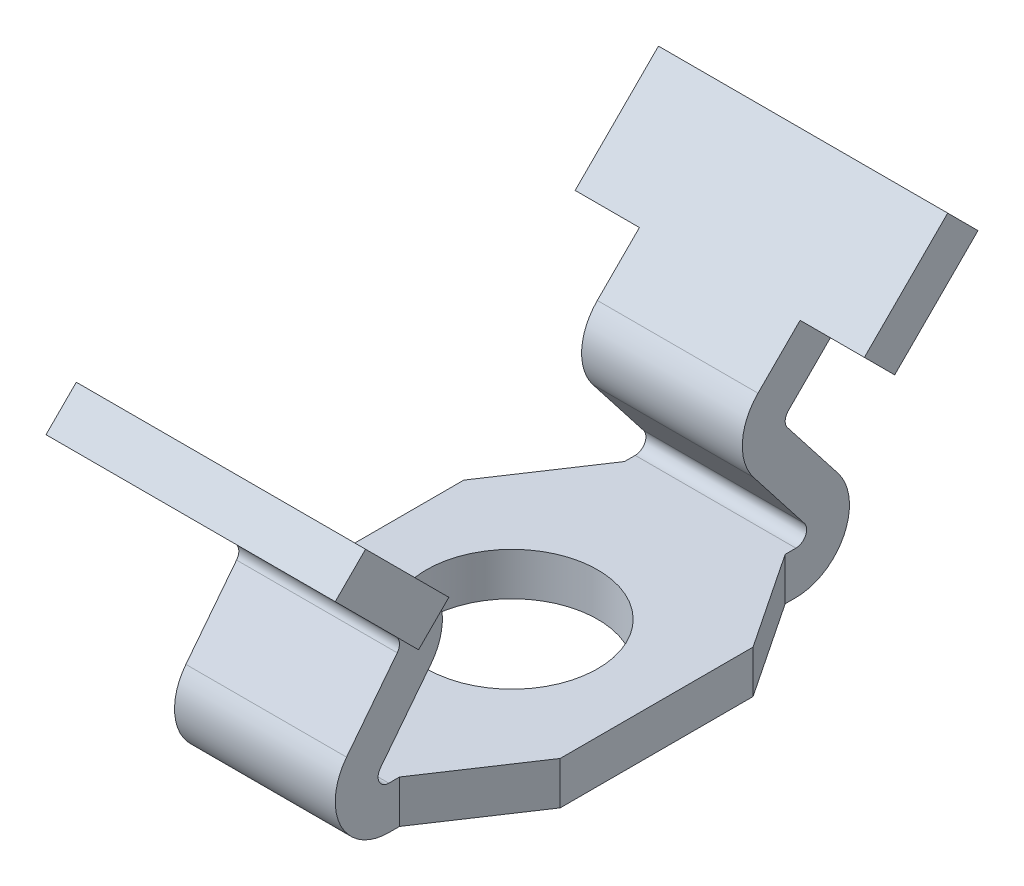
ISO-10303-21;
HEADER;
FILE_DESCRIPTION(('STEP AP214'),'2;1');
FILE_NAME('part.step','',(''),(''),'','','');
FILE_SCHEMA(('AUTOMOTIVE_DESIGN { 1 0 10303 214 1 1 1 1 }'));
ENDSEC;
DATA;
#1=APPLICATION_CONTEXT('core data for automotive mechanical design processes');
#2=APPLICATION_PROTOCOL_DEFINITION('international standard','automotive_design',2000,#1);
#3=PRODUCT_CONTEXT('',#1,'mechanical');
#4=PRODUCT('Part','Part','',(#3));
#5=PRODUCT_RELATED_PRODUCT_CATEGORY('part','',(#4));
#6=PRODUCT_DEFINITION_FORMATION('','',#4);
#7=PRODUCT_DEFINITION_CONTEXT('part definition',#1,'design');
#8=PRODUCT_DEFINITION('design','',#6,#7);
#9=PRODUCT_DEFINITION_SHAPE('','',#8);
#10=(LENGTH_UNIT() NAMED_UNIT(*) SI_UNIT(.MILLI.,.METRE.));
#11=(NAMED_UNIT(*) PLANE_ANGLE_UNIT() SI_UNIT($,.RADIAN.));
#12=(NAMED_UNIT(*) SI_UNIT($,.STERADIAN.) SOLID_ANGLE_UNIT());
#13=UNCERTAINTY_MEASURE_WITH_UNIT(LENGTH_MEASURE(1.E-05),#10,'distance_accuracy_value','');
#14=(GEOMETRIC_REPRESENTATION_CONTEXT(3) GLOBAL_UNCERTAINTY_ASSIGNED_CONTEXT((#13)) GLOBAL_UNIT_ASSIGNED_CONTEXT((#10,
#11,#12)) REPRESENTATION_CONTEXT('',''));
#15=CARTESIAN_POINT('',(0.,0.,0.));
#16=DIRECTION('',(0.,0.,1.));
#17=DIRECTION('',(1.,0.,0.));
#18=AXIS2_PLACEMENT_3D('',#15,#16,#17);
#19=CARTESIAN_POINT('',(6.75,-2.74452334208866,0.));
#20=DIRECTION('',(1.,0.,0.));
#21=DIRECTION('',(0.,0.,-1.));
#22=AXIS2_PLACEMENT_3D('',#19,#20,#21);
#23=PLANE('',#22);
#24=DIRECTION('',(0.,-0.707106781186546,0.707106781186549));
#25=VECTOR('',#24,1.);
#26=CARTESIAN_POINT('',(6.75,5.18884242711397,15.0000000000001));
#27=LINE('',#26,#25);
#28=CARTESIAN_POINT('',(6.75,5.18884242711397,15.0000000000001));
#29=VERTEX_POINT('',#28);
#30=CARTESIAN_POINT('',(6.75000000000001,6.60305598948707,13.585786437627));
#31=VERTEX_POINT('',#30);
#32=EDGE_CURVE('E453',#29,#31,#27,.F.);
#33=ORIENTED_EDGE('',*,*,#32,.F.);
#34=DIRECTION('',(0.,-0.707106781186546,-0.707106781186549));
#35=VECTOR('',#34,1.);
#36=CARTESIAN_POINT('',(6.75,1.29975513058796,11.110912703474));
#37=LINE('',#36,#35);
#38=CARTESIAN_POINT('',(6.75,1.29975513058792,11.110912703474));
#39=VERTEX_POINT('',#38);
#40=EDGE_CURVE('E418',#39,#29,#37,.F.);
#41=ORIENTED_EDGE('',*,*,#40,.F.);
#42=DIRECTION('',(0.,-0.707106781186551,0.707106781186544));
#43=VECTOR('',#42,1.);
#44=CARTESIAN_POINT('',(6.75,0.,12.4106678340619));
#45=LINE('',#44,#43);
#46=CARTESIAN_POINT('',(6.75000000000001,2.71396869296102,9.69669914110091));
#47=VERTEX_POINT('',#46);
#48=EDGE_CURVE('E441',#39,#47,#45,.F.);
#49=ORIENTED_EDGE('',*,*,#48,.T.);
#50=DIRECTION('',(0.,0.707106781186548,0.707106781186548));
#51=VECTOR('',#50,1.);
#52=CARTESIAN_POINT('',(6.75000000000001,2.71396869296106,9.69669914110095));
#53=LINE('',#52,#51);
#54=EDGE_CURVE('E412',#31,#47,#53,.F.);
#55=ORIENTED_EDGE('',*,*,#54,.F.);
#56=EDGE_LOOP('',(#33,#41,#49,#55));
#57=FACE_BOUND('',#56,.T.);
#58=ADVANCED_FACE('F15',(#57),#23,.T.);
#59=CARTESIAN_POINT('',(-6.75,5.18884242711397,15.0000000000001));
#60=DIRECTION('',(0.,0.707106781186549,0.707106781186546));
#61=DIRECTION('',(0.,-0.707106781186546,0.707106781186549));
#62=AXIS2_PLACEMENT_3D('',#59,#60,#61);
#63=PLANE('',#62);
#64=DIRECTION('',(0.,-0.707106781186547,0.707106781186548));
#65=VECTOR('',#64,1.);
#66=CARTESIAN_POINT('',(-6.75,6.60305598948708,13.585786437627));
#67=LINE('',#66,#65);
#68=CARTESIAN_POINT('',(-6.75,6.60305598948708,13.585786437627));
#69=VERTEX_POINT('',#68);
#70=CARTESIAN_POINT('',(-6.75,5.18884242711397,15.0000000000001));
#71=VERTEX_POINT('',#70);
#72=EDGE_CURVE('E436',#69,#71,#67,.T.);
#73=ORIENTED_EDGE('',*,*,#72,.T.);
#74=DIRECTION('',(1.,0.,0.));
#75=VECTOR('',#74,1.);
#76=CARTESIAN_POINT('',(-6.75,5.18884242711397,15.0000000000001));
#77=LINE('',#76,#75);
#78=EDGE_CURVE('E451',#29,#71,#77,.F.);
#79=ORIENTED_EDGE('',*,*,#78,.F.);
#80=ORIENTED_EDGE('',*,*,#32,.T.);
#81=DIRECTION('',(1.,0.,0.));
#82=VECTOR('',#81,1.);
#83=CARTESIAN_POINT('',(-6.75,6.60305598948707,13.585786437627));
#84=LINE('',#83,#82);
#85=EDGE_CURVE('E462',#69,#31,#84,.T.);
#86=ORIENTED_EDGE('',*,*,#85,.F.);
#87=EDGE_LOOP('',(#73,#79,#80,#86));
#88=FACE_BOUND('',#87,.T.);
#89=ADVANCED_FACE('F883',(#88),#63,.T.);
#90=CARTESIAN_POINT('',(-6.75,-2.74452334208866,0.));
#91=DIRECTION('',(1.,0.,0.));
#92=DIRECTION('',(0.,0.,-1.));
#93=AXIS2_PLACEMENT_3D('',#90,#91,#92);
#94=PLANE('',#93);
#95=DIRECTION('',(0.,-0.707106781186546,-0.707106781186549));
#96=VECTOR('',#95,1.);
#97=CARTESIAN_POINT('',(-6.75,1.29975513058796,11.110912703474));
#98=LINE('',#97,#96);
#99=CARTESIAN_POINT('',(-6.75,1.29975513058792,11.110912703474));
#100=VERTEX_POINT('',#99);
#101=EDGE_CURVE('E389',#71,#100,#98,.T.);
#102=ORIENTED_EDGE('',*,*,#101,.F.);
#103=ORIENTED_EDGE('',*,*,#72,.F.);
#104=DIRECTION('',(0.,0.707106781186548,0.707106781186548));
#105=VECTOR('',#104,1.);
#106=CARTESIAN_POINT('',(-6.75,2.71396869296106,9.69669914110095));
#107=LINE('',#106,#105);
#108=CARTESIAN_POINT('',(-6.75,2.71396869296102,9.69669914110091));
#109=VERTEX_POINT('',#108);
#110=EDGE_CURVE('E404',#109,#69,#107,.T.);
#111=ORIENTED_EDGE('',*,*,#110,.F.);
#112=DIRECTION('',(0.,-0.707106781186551,0.707106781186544));
#113=VECTOR('',#112,1.);
#114=CARTESIAN_POINT('',(-6.75,12.410667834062,0.));
#115=LINE('',#114,#113);
#116=EDGE_CURVE('E384',#109,#100,#115,.T.);
#117=ORIENTED_EDGE('',*,*,#116,.T.);
#118=EDGE_LOOP('',(#102,#103,#111,#117));
#119=FACE_BOUND('',#118,.T.);
#120=ADVANCED_FACE('F876',(#119),#94,.F.);
#121=CARTESIAN_POINT('',(6.75,-2.74452334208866,0.));
#122=DIRECTION('',(1.,0.,0.));
#123=DIRECTION('',(0.,0.,-1.));
#124=AXIS2_PLACEMENT_3D('',#121,#122,#123);
#125=PLANE('',#124);
#126=DIRECTION('',(0.,0.707106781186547,0.707106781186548));
#127=VECTOR('',#126,1.);
#128=CARTESIAN_POINT('',(6.75,6.60305598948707,-13.5857864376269));
#129=LINE('',#128,#127);
#130=CARTESIAN_POINT('',(6.75,6.60305598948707,-13.5857864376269));
#131=VERTEX_POINT('',#130);
#132=CARTESIAN_POINT('',(6.75,5.18884242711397,-15.));
#133=VERTEX_POINT('',#132);
#134=EDGE_CURVE('E432',#131,#133,#129,.F.);
#135=ORIENTED_EDGE('',*,*,#134,.F.);
#136=DIRECTION('',(0.,-0.707106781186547,0.707106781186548));
#137=VECTOR('',#136,1.);
#138=CARTESIAN_POINT('',(6.75,2.71396869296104,-9.69669914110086));
#139=LINE('',#138,#137);
#140=CARTESIAN_POINT('',(6.75,2.71396869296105,-9.69669914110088));
#141=VERTEX_POINT('',#140);
#142=EDGE_CURVE('E424',#141,#131,#139,.F.);
#143=ORIENTED_EDGE('',*,*,#142,.F.);
#144=DIRECTION('',(0.,0.707106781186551,0.707106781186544));
#145=VECTOR('',#144,1.);
#146=CARTESIAN_POINT('',(6.75,12.410667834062,0.));
#147=LINE('',#146,#145);
#148=CARTESIAN_POINT('',(6.75,1.29975513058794,-11.110912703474));
#149=VERTEX_POINT('',#148);
#150=EDGE_CURVE('E439',#141,#149,#147,.F.);
#151=ORIENTED_EDGE('',*,*,#150,.T.);
#152=DIRECTION('',(0.,0.707106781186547,-0.707106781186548));
#153=VECTOR('',#152,1.);
#154=CARTESIAN_POINT('',(6.75,1.29975513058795,-11.110912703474));
#155=LINE('',#154,#153);
#156=EDGE_CURVE('E419',#133,#149,#155,.F.);
#157=ORIENTED_EDGE('',*,*,#156,.F.);
#158=EDGE_LOOP('',(#135,#143,#151,#157));
#159=FACE_BOUND('',#158,.T.);
#160=ADVANCED_FACE('F627',(#159),#125,.T.);
#161=CARTESIAN_POINT('',(-6.75,6.60305598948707,-13.5857864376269));
#162=DIRECTION('',(0.,0.707106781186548,-0.707106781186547));
#163=DIRECTION('',(0.,0.707106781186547,0.707106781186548));
#164=AXIS2_PLACEMENT_3D('',#161,#162,#163);
#165=PLANE('',#164);
#166=DIRECTION('',(0.,0.707106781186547,0.707106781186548));
#167=VECTOR('',#166,1.);
#168=CARTESIAN_POINT('',(-6.75,5.18884242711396,-15.));
#169=LINE('',#168,#167);
#170=CARTESIAN_POINT('',(-6.75,5.18884242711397,-15.));
#171=VERTEX_POINT('',#170);
#172=CARTESIAN_POINT('',(-6.75,6.60305598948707,-13.5857864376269));
#173=VERTEX_POINT('',#172);
#174=EDGE_CURVE('E258',#171,#173,#169,.T.);
#175=ORIENTED_EDGE('',*,*,#174,.T.);
#176=DIRECTION('',(1.,0.,0.));
#177=VECTOR('',#176,1.);
#178=CARTESIAN_POINT('',(-6.75,6.60305598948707,-13.5857864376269));
#179=LINE('',#178,#177);
#180=EDGE_CURVE('E430',#131,#173,#179,.F.);
#181=ORIENTED_EDGE('',*,*,#180,.F.);
#182=ORIENTED_EDGE('',*,*,#134,.T.);
#183=DIRECTION('',(1.,0.,0.));
#184=VECTOR('',#183,1.);
#185=CARTESIAN_POINT('',(-6.75,5.18884242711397,-15.));
#186=LINE('',#185,#184);
#187=EDGE_CURVE('E444',#171,#133,#186,.T.);
#188=ORIENTED_EDGE('',*,*,#187,.F.);
#189=EDGE_LOOP('',(#175,#181,#182,#188));
#190=FACE_BOUND('',#189,.T.);
#191=ADVANCED_FACE('F631',(#190),#165,.T.);
#192=CARTESIAN_POINT('',(-6.75,-2.74452334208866,0.));
#193=DIRECTION('',(1.,0.,0.));
#194=DIRECTION('',(0.,0.,-1.));
#195=AXIS2_PLACEMENT_3D('',#192,#193,#194);
#196=PLANE('',#195);
#197=DIRECTION('',(0.,-0.707106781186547,0.707106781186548));
#198=VECTOR('',#197,1.);
#199=CARTESIAN_POINT('',(-6.75,2.71396869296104,-9.69669914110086));
#200=LINE('',#199,#198);
#201=CARTESIAN_POINT('',(-6.75,2.71396869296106,-9.69669914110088));
#202=VERTEX_POINT('',#201);
#203=EDGE_CURVE('E357',#173,#202,#200,.T.);
#204=ORIENTED_EDGE('',*,*,#203,.F.);
#205=ORIENTED_EDGE('',*,*,#174,.F.);
#206=DIRECTION('',(0.,0.707106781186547,-0.707106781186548));
#207=VECTOR('',#206,1.);
#208=CARTESIAN_POINT('',(-6.75,1.29975513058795,-11.110912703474));
#209=LINE('',#208,#207);
#210=CARTESIAN_POINT('',(-6.75,1.29975513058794,-11.110912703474));
#211=VERTEX_POINT('',#210);
#212=EDGE_CURVE('E388',#211,#171,#209,.T.);
#213=ORIENTED_EDGE('',*,*,#212,.F.);
#214=DIRECTION('',(0.,0.707106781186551,0.707106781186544));
#215=VECTOR('',#214,1.);
#216=CARTESIAN_POINT('',(-6.75,0.,-12.4106678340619));
#217=LINE('',#216,#215);
#218=EDGE_CURVE('E363',#211,#202,#217,.T.);
#219=ORIENTED_EDGE('',*,*,#218,.T.);
#220=EDGE_LOOP('',(#204,#205,#213,#219));
#221=FACE_BOUND('',#220,.T.);
#222=ADVANCED_FACE('F634',(#221),#196,.F.);
#223=CARTESIAN_POINT('',(-6.75,-1.01826435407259,-9.49999999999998));
#224=DIRECTION('',(1.,0.,0.));
#225=DIRECTION('',(0.,0.,-1.));
#226=AXIS2_PLACEMENT_3D('',#223,#224,#225);
#227=CYLINDRICAL_SURFACE('',#226,0.499999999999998);
#228=DIRECTION('',(1.,0.,0.));
#229=VECTOR('',#228,1.);
#230=CARTESIAN_POINT('',(-6.75,-0.664710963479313,-9.14644660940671));
#231=LINE('',#230,#229);
#232=CARTESIAN_POINT('',(3.75,-0.664710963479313,-9.14644660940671));
#233=VERTEX_POINT('',#232);
#234=CARTESIAN_POINT('',(-3.75,-0.664710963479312,-9.14644660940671));
#235=VERTEX_POINT('',#234);
#236=EDGE_CURVE('E260',#233,#235,#231,.F.);
#237=ORIENTED_EDGE('',*,*,#236,.F.);
#238=CARTESIAN_POINT('',(3.75,-1.01826435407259,-9.49999999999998));
#239=DIRECTION('',(1.,0.,0.));
#240=DIRECTION('',(0.,0.,-1.));
#241=AXIS2_PLACEMENT_3D('',#238,#239,#240);
#242=CIRCLE('',#241,0.499999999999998);
#243=CARTESIAN_POINT('',(3.75,-1.32572459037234,-9.1057054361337));
#244=VERTEX_POINT('',#243);
#245=EDGE_CURVE('E18',#244,#233,#242,.F.);
#246=ORIENTED_EDGE('',*,*,#245,.F.);
#247=DIRECTION('',(1.,0.,0.));
#248=VECTOR('',#247,1.);
#249=CARTESIAN_POINT('',(-6.75,-1.32572459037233,-9.1057054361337));
#250=LINE('',#249,#248);
#251=CARTESIAN_POINT('',(-3.75,-1.32572459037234,-9.1057054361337));
#252=VERTEX_POINT('',#251);
#253=EDGE_CURVE('E291',#252,#244,#250,.T.);
#254=ORIENTED_EDGE('',*,*,#253,.F.);
#255=CARTESIAN_POINT('',(-3.75,-1.01826435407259,-9.49999999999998));
#256=DIRECTION('',(1.,0.,0.));
#257=DIRECTION('',(0.,0.,-1.));
#258=AXIS2_PLACEMENT_3D('',#255,#256,#257);
#259=CIRCLE('',#258,0.499999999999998);
#260=EDGE_CURVE('E257',#235,#252,#259,.T.);
#261=ORIENTED_EDGE('',*,*,#260,.F.);
#262=EDGE_LOOP('',(#237,#246,#254,#261));
#263=FACE_BOUND('',#262,.T.);
#264=ADVANCED_FACE('F261',(#263),#227,.F.);
#265=CARTESIAN_POINT('',(3.75,12.410667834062,0.));
#266=DIRECTION('',(0.,0.707106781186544,-0.707106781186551));
#267=DIRECTION('',(0.,0.707106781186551,0.707106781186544));
#268=AXIS2_PLACEMENT_3D('',#265,#266,#267);
#269=PLANE('',#268);
#270=DIRECTION('',(0.,-0.70710678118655,-0.707106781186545));
#271=VECTOR('',#270,1.);
#272=CARTESIAN_POINT('',(3.75,2.71396869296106,-9.69669914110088));
#273=LINE('',#272,#271);
#274=CARTESIAN_POINT('',(3.75,2.71396869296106,-9.69669914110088));
#275=VERTEX_POINT('',#274);
#276=CARTESIAN_POINT('',(3.75,1.29975513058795,-11.110912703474));
#277=VERTEX_POINT('',#276);
#278=EDGE_CURVE('E272',#275,#277,#273,.T.);
#279=ORIENTED_EDGE('',*,*,#278,.T.);
#280=DIRECTION('',(1.,0.,0.));
#281=VECTOR('',#280,1.);
#282=CARTESIAN_POINT('',(-6.75,1.29975513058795,-11.110912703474));
#283=LINE('',#282,#281);
#284=EDGE_CURVE('E265',#149,#277,#283,.F.);
#285=ORIENTED_EDGE('',*,*,#284,.F.);
#286=ORIENTED_EDGE('',*,*,#150,.F.);
#287=DIRECTION('',(1.,0.,0.));
#288=VECTOR('',#287,1.);
#289=CARTESIAN_POINT('',(-6.75,2.71396869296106,-9.69669914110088));
#290=LINE('',#289,#288);
#291=EDGE_CURVE('E421',#275,#141,#290,.T.);
#292=ORIENTED_EDGE('',*,*,#291,.F.);
#293=EDGE_LOOP('',(#279,#285,#286,#292));
#294=FACE_BOUND('',#293,.T.);
#295=ADVANCED_FACE('F624',(#294),#269,.F.);
#296=CARTESIAN_POINT('',(3.75,0.,12.4106678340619));
#297=DIRECTION('',(0.,0.707106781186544,0.707106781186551));
#298=DIRECTION('',(0.,-0.707106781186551,0.707106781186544));
#299=AXIS2_PLACEMENT_3D('',#296,#297,#298);
#300=PLANE('',#299);
#301=ORIENTED_EDGE('',*,*,#48,.F.);
#302=DIRECTION('',(1.,0.,0.));
#303=VECTOR('',#302,1.);
#304=CARTESIAN_POINT('',(-6.75,1.29975513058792,11.110912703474));
#305=LINE('',#304,#303);
#306=CARTESIAN_POINT('',(3.75,1.29975513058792,11.110912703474));
#307=VERTEX_POINT('',#306);
#308=EDGE_CURVE('E383',#307,#39,#305,.T.);
#309=ORIENTED_EDGE('',*,*,#308,.F.);
#310=DIRECTION('',(0.,0.707106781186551,-0.707106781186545));
#311=VECTOR('',#310,1.);
#312=CARTESIAN_POINT('',(3.75,1.29975513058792,11.110912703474));
#313=LINE('',#312,#311);
#314=CARTESIAN_POINT('',(3.75,2.71396869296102,9.69669914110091));
#315=VERTEX_POINT('',#314);
#316=EDGE_CURVE('E413',#307,#315,#313,.T.);
#317=ORIENTED_EDGE('',*,*,#316,.T.);
#318=DIRECTION('',(1.,0.,0.));
#319=VECTOR('',#318,1.);
#320=CARTESIAN_POINT('',(-6.75,2.71396869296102,9.69669914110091));
#321=LINE('',#320,#319);
#322=EDGE_CURVE('E400',#47,#315,#321,.F.);
#323=ORIENTED_EDGE('',*,*,#322,.F.);
#324=EDGE_LOOP('',(#301,#309,#317,#323));
#325=FACE_BOUND('',#324,.T.);
#326=ADVANCED_FACE('F838',(#325),#300,.F.);
#327=CARTESIAN_POINT('',(-6.75,-1.01826435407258,9.50000000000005));
#328=DIRECTION('',(1.,0.,0.));
#329=DIRECTION('',(0.,0.,-1.));
#330=AXIS2_PLACEMENT_3D('',#327,#328,#329);
#331=CYLINDRICAL_SURFACE('',#330,0.5);
#332=DIRECTION('',(1.,0.,0.));
#333=VECTOR('',#332,1.);
#334=CARTESIAN_POINT('',(-6.75,-1.32572459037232,9.10570543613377));
#335=LINE('',#334,#333);
#336=CARTESIAN_POINT('',(3.75,-1.32572459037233,9.10570543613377));
#337=VERTEX_POINT('',#336);
#338=CARTESIAN_POINT('',(-3.75,-1.32572459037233,9.10570543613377));
#339=VERTEX_POINT('',#338);
#340=EDGE_CURVE('E376',#337,#339,#335,.F.);
#341=ORIENTED_EDGE('',*,*,#340,.F.);
#342=CARTESIAN_POINT('',(3.75,-1.01826435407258,9.50000000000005));
#343=DIRECTION('',(1.,0.,0.));
#344=DIRECTION('',(0.,0.,-1.));
#345=AXIS2_PLACEMENT_3D('',#342,#343,#344);
#346=CIRCLE('',#345,0.5);
#347=CARTESIAN_POINT('',(3.75,-0.664710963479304,9.14644660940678));
#348=VERTEX_POINT('',#347);
#349=EDGE_CURVE('E271',#337,#348,#346,.T.);
#350=ORIENTED_EDGE('',*,*,#349,.T.);
#351=DIRECTION('',(1.,0.,0.));
#352=VECTOR('',#351,1.);
#353=CARTESIAN_POINT('',(-6.75,-0.664710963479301,9.14644660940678));
#354=LINE('',#353,#352);
#355=CARTESIAN_POINT('',(-3.75,-0.664710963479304,9.14644660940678));
#356=VERTEX_POINT('',#355);
#357=EDGE_CURVE('E380',#356,#348,#354,.T.);
#358=ORIENTED_EDGE('',*,*,#357,.F.);
#359=CARTESIAN_POINT('',(-3.75,-1.01826435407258,9.50000000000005));
#360=DIRECTION('',(1.,0.,0.));
#361=DIRECTION('',(0.,0.,-1.));
#362=AXIS2_PLACEMENT_3D('',#359,#360,#361);
#363=CIRCLE('',#362,0.5);
#364=EDGE_CURVE('E405',#339,#356,#363,.T.);
#365=ORIENTED_EDGE('',*,*,#364,.F.);
#366=EDGE_LOOP('',(#341,#350,#358,#365));
#367=FACE_BOUND('',#366,.T.);
#368=ADVANCED_FACE('F560',(#367),#331,.F.);
#369=CARTESIAN_POINT('',(-6.75,-2.55556553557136,7.52852718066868));
#370=DIRECTION('',(0.,-0.614920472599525,-0.788589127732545));
#371=DIRECTION('',(0.,0.788589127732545,-0.614920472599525));
#372=AXIS2_PLACEMENT_3D('',#369,#370,#371);
#373=PLANE('',#372);
#374=DIRECTION('',(0.,-0.788589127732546,0.614920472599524));
#375=VECTOR('',#374,1.);
#376=CARTESIAN_POINT('',(3.75,-2.55556553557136,7.52852718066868));
#377=LINE('',#376,#375);
#378=CARTESIAN_POINT('',(3.75,-2.55556553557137,7.52852718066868));
#379=VERTEX_POINT('',#378);
#380=CARTESIAN_POINT('',(3.75,-5.58948377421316,9.89429456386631));
#381=VERTEX_POINT('',#380);
#382=EDGE_CURVE('E494',#379,#381,#377,.T.);
#383=ORIENTED_EDGE('',*,*,#382,.T.);
#384=DIRECTION('',(1.,0.,0.));
#385=VECTOR('',#384,1.);
#386=CARTESIAN_POINT('',(-6.75,-5.58948377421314,9.8942945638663));
#387=LINE('',#386,#385);
#388=CARTESIAN_POINT('',(-3.75,-5.58948377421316,9.89429456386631));
#389=VERTEX_POINT('',#388);
#390=EDGE_CURVE('E350',#381,#389,#387,.F.);
#391=ORIENTED_EDGE('',*,*,#390,.T.);
#392=DIRECTION('',(0.,0.788589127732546,-0.614920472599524));
#393=VECTOR('',#392,1.);
#394=CARTESIAN_POINT('',(-3.75,-5.58948377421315,9.8942945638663));
#395=LINE('',#394,#393);
#396=CARTESIAN_POINT('',(-3.75,-2.55556553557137,7.52852718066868));
#397=VERTEX_POINT('',#396);
#398=EDGE_CURVE('E379',#389,#397,#395,.T.);
#399=ORIENTED_EDGE('',*,*,#398,.T.);
#400=DIRECTION('',(1.,0.,0.));
#401=VECTOR('',#400,1.);
#402=CARTESIAN_POINT('',(-6.75,-2.55556553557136,7.52852718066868));
#403=LINE('',#402,#401);
#404=EDGE_CURVE('E401',#379,#397,#403,.F.);
#405=ORIENTED_EDGE('',*,*,#404,.F.);
#406=EDGE_LOOP('',(#383,#391,#399,#405));
#407=FACE_BOUND('',#406,.T.);
#408=ADVANCED_FACE('F581',(#407),#373,.T.);
#409=CARTESIAN_POINT('',(-6.75,-1.01826435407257,9.50000000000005));
#410=DIRECTION('',(1.,0.,0.));
#411=DIRECTION('',(0.,0.,-1.));
#412=AXIS2_PLACEMENT_3D('',#409,#410,#411);
#413=CYLINDRICAL_SURFACE('',#412,2.5);
#414=CARTESIAN_POINT('',(3.75,-1.01826435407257,9.50000000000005));
#415=DIRECTION('',(1.,0.,0.));
#416=DIRECTION('',(0.,0.,-1.));
#417=AXIS2_PLACEMENT_3D('',#414,#415,#416);
#418=CIRCLE('',#417,2.5);
#419=CARTESIAN_POINT('',(3.75,0.749502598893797,7.73223304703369));
#420=VERTEX_POINT('',#419);
#421=EDGE_CURVE('E495',#420,#379,#418,.F.);
#422=ORIENTED_EDGE('',*,*,#421,.T.);
#423=ORIENTED_EDGE('',*,*,#404,.T.);
#424=CARTESIAN_POINT('',(-3.75,-1.01826435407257,9.50000000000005));
#425=DIRECTION('',(1.,0.,0.));
#426=DIRECTION('',(0.,0.,-1.));
#427=AXIS2_PLACEMENT_3D('',#424,#425,#426);
#428=CIRCLE('',#427,2.5);
#429=CARTESIAN_POINT('',(-3.75,0.749502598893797,7.73223304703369));
#430=VERTEX_POINT('',#429);
#431=EDGE_CURVE('E489',#397,#430,#428,.T.);
#432=ORIENTED_EDGE('',*,*,#431,.T.);
#433=DIRECTION('',(1.,0.,0.));
#434=VECTOR('',#433,1.);
#435=CARTESIAN_POINT('',(-6.75,0.749502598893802,7.73223304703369));
#436=LINE('',#435,#434);
#437=EDGE_CURVE('E397',#420,#430,#436,.F.);
#438=ORIENTED_EDGE('',*,*,#437,.F.);
#439=EDGE_LOOP('',(#422,#423,#432,#438));
#440=FACE_BOUND('',#439,.T.);
#441=ADVANCED_FACE('F577',(#440),#413,.T.);
#442=CARTESIAN_POINT('',(-6.75,2.71396869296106,9.69669914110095));
#443=DIRECTION('',(0.,0.707106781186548,-0.707106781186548));
#444=DIRECTION('',(0.,0.707106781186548,0.707106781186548));
#445=AXIS2_PLACEMENT_3D('',#442,#443,#444);
#446=PLANE('',#445);
#447=DIRECTION('',(0.,-0.707106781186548,-0.707106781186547));
#448=VECTOR('',#447,1.);
#449=CARTESIAN_POINT('',(3.75,2.71396869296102,9.69669914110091));
#450=LINE('',#449,#448);
#451=EDGE_CURVE('E415',#315,#420,#450,.T.);
#452=ORIENTED_EDGE('',*,*,#451,.T.);
#453=ORIENTED_EDGE('',*,*,#437,.T.);
#454=DIRECTION('',(0.,0.707106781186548,0.707106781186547));
#455=VECTOR('',#454,1.);
#456=CARTESIAN_POINT('',(-3.75,0.749502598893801,7.73223304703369));
#457=LINE('',#456,#455);
#458=CARTESIAN_POINT('',(-3.75,2.71396869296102,9.69669914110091));
#459=VERTEX_POINT('',#458);
#460=EDGE_CURVE('E393',#430,#459,#457,.T.);
#461=ORIENTED_EDGE('',*,*,#460,.T.);
#462=DIRECTION('',(1.,0.,0.));
#463=VECTOR('',#462,1.);
#464=CARTESIAN_POINT('',(-3.75,2.71396869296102,9.69669914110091));
#465=LINE('',#464,#463);
#466=EDGE_CURVE('E394',#459,#109,#465,.F.);
#467=ORIENTED_EDGE('',*,*,#466,.T.);
#468=ORIENTED_EDGE('',*,*,#110,.T.);
#469=ORIENTED_EDGE('',*,*,#85,.T.);
#470=ORIENTED_EDGE('',*,*,#54,.T.);
#471=ORIENTED_EDGE('',*,*,#322,.T.);
#472=EDGE_LOOP('',(#452,#453,#461,#467,#468,#469,#470,#471));
#473=FACE_BOUND('',#472,.T.);
#474=ADVANCED_FACE('F573',(#473),#446,.T.);
#475=CARTESIAN_POINT('',(-3.75,12.410667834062,0.));
#476=DIRECTION('',(0.,0.707106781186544,0.707106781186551));
#477=DIRECTION('',(0.,-0.707106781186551,0.707106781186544));
#478=AXIS2_PLACEMENT_3D('',#475,#476,#477);
#479=PLANE('',#478);
#480=ORIENTED_EDGE('',*,*,#116,.F.);
#481=ORIENTED_EDGE('',*,*,#466,.F.);
#482=DIRECTION('',(0.,-0.707106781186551,0.707106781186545));
#483=VECTOR('',#482,1.);
#484=CARTESIAN_POINT('',(-3.75,2.71396869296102,9.69669914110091));
#485=LINE('',#484,#483);
#486=CARTESIAN_POINT('',(-3.75,1.29975513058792,11.110912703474));
#487=VERTEX_POINT('',#486);
#488=EDGE_CURVE('E390',#459,#487,#485,.T.);
#489=ORIENTED_EDGE('',*,*,#488,.T.);
#490=DIRECTION('',(1.,0.,0.));
#491=VECTOR('',#490,1.);
#492=CARTESIAN_POINT('',(-6.75,1.29975513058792,11.110912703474));
#493=LINE('',#492,#491);
#494=EDGE_CURVE('E385',#100,#487,#493,.T.);
#495=ORIENTED_EDGE('',*,*,#494,.F.);
#496=EDGE_LOOP('',(#480,#481,#489,#495));
#497=FACE_BOUND('',#496,.T.);
#498=ADVANCED_FACE('F570',(#497),#479,.F.);
#499=CARTESIAN_POINT('',(-6.75,1.29975513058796,11.110912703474));
#500=DIRECTION('',(0.,-0.707106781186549,0.707106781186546));
#501=DIRECTION('',(0.,-0.707106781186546,-0.707106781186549));
#502=AXIS2_PLACEMENT_3D('',#499,#500,#501);
#503=PLANE('',#502);
#504=ORIENTED_EDGE('',*,*,#101,.T.);
#505=ORIENTED_EDGE('',*,*,#494,.T.);
#506=DIRECTION('',(0.,-0.707106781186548,-0.707106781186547));
#507=VECTOR('',#506,1.);
#508=CARTESIAN_POINT('',(-3.75,1.29975513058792,11.110912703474));
#509=LINE('',#508,#507);
#510=EDGE_CURVE('E392',#487,#356,#509,.T.);
#511=ORIENTED_EDGE('',*,*,#510,.T.);
#512=ORIENTED_EDGE('',*,*,#357,.T.);
#513=DIRECTION('',(0.,0.707106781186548,0.707106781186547));
#514=VECTOR('',#513,1.);
#515=CARTESIAN_POINT('',(3.75,-0.664710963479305,9.14644660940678));
#516=LINE('',#515,#514);
#517=EDGE_CURVE('E274',#348,#307,#516,.T.);
#518=ORIENTED_EDGE('',*,*,#517,.T.);
#519=ORIENTED_EDGE('',*,*,#308,.T.);
#520=ORIENTED_EDGE('',*,*,#40,.T.);
#521=ORIENTED_EDGE('',*,*,#78,.T.);
#522=EDGE_LOOP('',(#504,#505,#511,#512,#518,#519,#520,#521));
#523=FACE_BOUND('',#522,.T.);
#524=ADVANCED_FACE('F565',(#523),#503,.T.);
#525=CARTESIAN_POINT('',(-6.75,-5.58948377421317,-9.89429456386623));
#526=DIRECTION('',(0.,-0.614920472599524,0.788589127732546));
#527=DIRECTION('',(0.,-0.788589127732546,-0.614920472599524));
#528=AXIS2_PLACEMENT_3D('',#525,#526,#527);
#529=PLANE('',#528);
#530=DIRECTION('',(0.,0.788589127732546,0.614920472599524));
#531=VECTOR('',#530,1.);
#532=CARTESIAN_POINT('',(3.75,-5.58948377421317,-9.89429456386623));
#533=LINE('',#532,#531);
#534=CARTESIAN_POINT('',(3.75,-5.58948377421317,-9.89429456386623));
#535=VERTEX_POINT('',#534);
#536=CARTESIAN_POINT('',(3.75,-2.55556553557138,-7.52852718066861));
#537=VERTEX_POINT('',#536);
#538=EDGE_CURVE('E285',#535,#537,#533,.T.);
#539=ORIENTED_EDGE('',*,*,#538,.T.);
#540=DIRECTION('',(1.,0.,0.));
#541=VECTOR('',#540,1.);
#542=CARTESIAN_POINT('',(-6.75,-2.55556553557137,-7.5285271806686));
#543=LINE('',#542,#541);
#544=CARTESIAN_POINT('',(-3.75,-2.55556553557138,-7.52852718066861));
#545=VERTEX_POINT('',#544);
#546=EDGE_CURVE('E351',#545,#537,#543,.T.);
#547=ORIENTED_EDGE('',*,*,#546,.F.);
#548=DIRECTION('',(0.,-0.788589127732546,-0.614920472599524));
#549=VECTOR('',#548,1.);
#550=CARTESIAN_POINT('',(-3.75,-2.55556553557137,-7.5285271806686));
#551=LINE('',#550,#549);
#552=CARTESIAN_POINT('',(-3.75,-5.58948377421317,-9.89429456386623));
#553=VERTEX_POINT('',#552);
#554=EDGE_CURVE('E484',#545,#553,#551,.T.);
#555=ORIENTED_EDGE('',*,*,#554,.T.);
#556=DIRECTION('',(1.,0.,0.));
#557=VECTOR('',#556,1.);
#558=CARTESIAN_POINT('',(-6.75,-5.58948377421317,-9.89429456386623));
#559=LINE('',#558,#557);
#560=EDGE_CURVE('E366',#553,#535,#559,.T.);
#561=ORIENTED_EDGE('',*,*,#560,.T.);
#562=EDGE_LOOP('',(#539,#547,#555,#561));
#563=FACE_BOUND('',#562,.T.);
#564=ADVANCED_FACE('F617',(#563),#529,.T.);
#565=CARTESIAN_POINT('',(-6.75,1.29975513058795,-11.110912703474));
#566=DIRECTION('',(0.,-0.707106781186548,-0.707106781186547));
#567=DIRECTION('',(0.,0.707106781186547,-0.707106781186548));
#568=AXIS2_PLACEMENT_3D('',#565,#566,#567);
#569=PLANE('',#568);
#570=DIRECTION('',(0.,-0.707106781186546,0.707106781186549));
#571=VECTOR('',#570,1.);
#572=CARTESIAN_POINT('',(3.75,1.29975513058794,-11.110912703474));
#573=LINE('',#572,#571);
#574=EDGE_CURVE('E254',#277,#233,#573,.T.);
#575=ORIENTED_EDGE('',*,*,#574,.T.);
#576=ORIENTED_EDGE('',*,*,#236,.T.);
#577=DIRECTION('',(0.,0.707106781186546,-0.707106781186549));
#578=VECTOR('',#577,1.);
#579=CARTESIAN_POINT('',(-3.75,-0.664710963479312,-9.14644660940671));
#580=LINE('',#579,#578);
#581=CARTESIAN_POINT('',(-3.75,1.29975513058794,-11.110912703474));
#582=VERTEX_POINT('',#581);
#583=EDGE_CURVE('E361',#235,#582,#580,.T.);
#584=ORIENTED_EDGE('',*,*,#583,.T.);
#585=DIRECTION('',(1.,0.,0.));
#586=VECTOR('',#585,1.);
#587=CARTESIAN_POINT('',(-3.75,1.29975513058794,-11.110912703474));
#588=LINE('',#587,#586);
#589=EDGE_CURVE('E264',#582,#211,#588,.F.);
#590=ORIENTED_EDGE('',*,*,#589,.T.);
#591=ORIENTED_EDGE('',*,*,#212,.T.);
#592=ORIENTED_EDGE('',*,*,#187,.T.);
#593=ORIENTED_EDGE('',*,*,#156,.T.);
#594=ORIENTED_EDGE('',*,*,#284,.T.);
#595=EDGE_LOOP('',(#575,#576,#584,#590,#591,#592,#593,#594));
#596=FACE_BOUND('',#595,.T.);
#597=ADVANCED_FACE('F268',(#596),#569,.T.);
#598=CARTESIAN_POINT('',(-3.75,0.,-12.4106678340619));
#599=DIRECTION('',(0.,0.707106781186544,-0.707106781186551));
#600=DIRECTION('',(0.,0.707106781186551,0.707106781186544));
#601=AXIS2_PLACEMENT_3D('',#598,#599,#600);
#602=PLANE('',#601);
#603=ORIENTED_EDGE('',*,*,#218,.F.);
#604=ORIENTED_EDGE('',*,*,#589,.F.);
#605=DIRECTION('',(0.,0.70710678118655,0.707106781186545));
#606=VECTOR('',#605,1.);
#607=CARTESIAN_POINT('',(-3.75,1.29975513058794,-11.110912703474));
#608=LINE('',#607,#606);
#609=CARTESIAN_POINT('',(-3.75,2.71396869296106,-9.69669914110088));
#610=VERTEX_POINT('',#609);
#611=EDGE_CURVE('E358',#582,#610,#608,.T.);
#612=ORIENTED_EDGE('',*,*,#611,.T.);
#613=DIRECTION('',(1.,0.,0.));
#614=VECTOR('',#613,1.);
#615=CARTESIAN_POINT('',(-6.75,2.71396869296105,-9.69669914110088));
#616=LINE('',#615,#614);
#617=EDGE_CURVE('E354',#202,#610,#616,.T.);
#618=ORIENTED_EDGE('',*,*,#617,.F.);
#619=EDGE_LOOP('',(#603,#604,#612,#618));
#620=FACE_BOUND('',#619,.T.);
#621=ADVANCED_FACE('F638',(#620),#602,.F.);
#622=CARTESIAN_POINT('',(-6.75,2.71396869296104,-9.69669914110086));
#623=DIRECTION('',(0.,0.707106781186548,0.707106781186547));
#624=DIRECTION('',(0.,-0.707106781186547,0.707106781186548));
#625=AXIS2_PLACEMENT_3D('',#622,#623,#624);
#626=PLANE('',#625);
#627=ORIENTED_EDGE('',*,*,#203,.T.);
#628=ORIENTED_EDGE('',*,*,#617,.T.);
#629=DIRECTION('',(0.,-0.707106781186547,0.707106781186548));
#630=VECTOR('',#629,1.);
#631=CARTESIAN_POINT('',(-3.75,2.71396869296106,-9.69669914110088));
#632=LINE('',#631,#630);
#633=CARTESIAN_POINT('',(-3.75,0.749502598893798,-7.73223304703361));
#634=VERTEX_POINT('',#633);
#635=EDGE_CURVE('E360',#610,#634,#632,.T.);
#636=ORIENTED_EDGE('',*,*,#635,.T.);
#637=DIRECTION('',(1.,0.,0.));
#638=VECTOR('',#637,1.);
#639=CARTESIAN_POINT('',(-6.75,0.749502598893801,-7.73223304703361));
#640=LINE('',#639,#638);
#641=CARTESIAN_POINT('',(3.75,0.749502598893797,-7.73223304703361));
#642=VERTEX_POINT('',#641);
#643=EDGE_CURVE('E347',#642,#634,#640,.F.);
#644=ORIENTED_EDGE('',*,*,#643,.F.);
#645=DIRECTION('',(0.,0.707106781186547,-0.707106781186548));
#646=VECTOR('',#645,1.);
#647=CARTESIAN_POINT('',(3.75,0.749502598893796,-7.73223304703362));
#648=LINE('',#647,#646);
#649=EDGE_CURVE('E276',#642,#275,#648,.T.);
#650=ORIENTED_EDGE('',*,*,#649,.T.);
#651=ORIENTED_EDGE('',*,*,#291,.T.);
#652=ORIENTED_EDGE('',*,*,#142,.T.);
#653=ORIENTED_EDGE('',*,*,#180,.T.);
#654=EDGE_LOOP('',(#627,#628,#636,#644,#650,#651,#652,#653));
#655=FACE_BOUND('',#654,.T.);
#656=ADVANCED_FACE('F605',(#655),#626,.T.);
#657=CARTESIAN_POINT('',(-6.75,-1.01826435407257,-9.49999999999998));
#658=DIRECTION('',(1.,0.,0.));
#659=DIRECTION('',(0.,0.,-1.));
#660=AXIS2_PLACEMENT_3D('',#657,#658,#659);
#661=CYLINDRICAL_SURFACE('',#660,2.5);
#662=CARTESIAN_POINT('',(3.75,-1.01826435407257,-9.49999999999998));
#663=DIRECTION('',(1.,0.,0.));
#664=DIRECTION('',(0.,0.,-1.));
#665=AXIS2_PLACEMENT_3D('',#662,#663,#664);
#666=CIRCLE('',#665,2.5);
#667=EDGE_CURVE('E284',#537,#642,#666,.F.);
#668=ORIENTED_EDGE('',*,*,#667,.T.);
#669=ORIENTED_EDGE('',*,*,#643,.T.);
#670=CARTESIAN_POINT('',(-3.75,-1.01826435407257,-9.49999999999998));
#671=DIRECTION('',(1.,0.,0.));
#672=DIRECTION('',(0.,0.,-1.));
#673=AXIS2_PLACEMENT_3D('',#670,#671,#672);
#674=CIRCLE('',#673,2.5);
#675=EDGE_CURVE('E341',#634,#545,#674,.T.);
#676=ORIENTED_EDGE('',*,*,#675,.T.);
#677=ORIENTED_EDGE('',*,*,#546,.T.);
#678=EDGE_LOOP('',(#668,#669,#676,#677));
#679=FACE_BOUND('',#678,.T.);
#680=ADVANCED_FACE('F609',(#679),#661,.T.);
#681=CARTESIAN_POINT('',(-6.75,-5.89694401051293,9.50000000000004));
#682=DIRECTION('',(1.,0.,0.));
#683=DIRECTION('',(0.,0.,-1.));
#684=AXIS2_PLACEMENT_3D('',#681,#682,#683);
#685=CYLINDRICAL_SURFACE('',#684,0.5);
#686=ORIENTED_EDGE('',*,*,#390,.F.);
#687=CARTESIAN_POINT('',(3.75,-5.89694401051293,9.50000000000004));
#688=DIRECTION('',(1.,0.,0.));
#689=DIRECTION('',(0.,0.,-1.));
#690=AXIS2_PLACEMENT_3D('',#687,#688,#689);
#691=CIRCLE('',#690,0.5);
#692=CARTESIAN_POINT('',(3.75,-6.39694401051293,9.50000000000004));
#693=VERTEX_POINT('',#692);
#694=EDGE_CURVE('E491',#381,#693,#691,.T.);
#695=ORIENTED_EDGE('',*,*,#694,.T.);
#696=DIRECTION('',(1.,0.,0.));
#697=VECTOR('',#696,1.);
#698=CARTESIAN_POINT('',(-6.75,-6.39694401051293,9.50000000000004));
#699=LINE('',#698,#697);
#700=CARTESIAN_POINT('',(-3.75,-6.39694401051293,9.50000000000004));
#701=VERTEX_POINT('',#700);
#702=EDGE_CURVE('E316',#701,#693,#699,.T.);
#703=ORIENTED_EDGE('',*,*,#702,.F.);
#704=CARTESIAN_POINT('',(-3.75,-5.89694401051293,9.50000000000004));
#705=DIRECTION('',(1.,0.,0.));
#706=DIRECTION('',(0.,0.,-1.));
#707=AXIS2_PLACEMENT_3D('',#704,#705,#706);
#708=CIRCLE('',#707,0.5);
#709=EDGE_CURVE('E485',#701,#389,#708,.F.);
#710=ORIENTED_EDGE('',*,*,#709,.T.);
#711=EDGE_LOOP('',(#686,#695,#703,#710));
#712=FACE_BOUND('',#711,.T.);
#713=ADVANCED_FACE('F586',(#712),#685,.F.);
#714=CARTESIAN_POINT('',(-6.75,-5.89694401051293,-9.49999999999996));
#715=DIRECTION('',(1.,0.,0.));
#716=DIRECTION('',(0.,0.,-1.));
#717=AXIS2_PLACEMENT_3D('',#714,#715,#716);
#718=CYLINDRICAL_SURFACE('',#717,0.5);
#719=DIRECTION('',(1.,0.,0.));
#720=VECTOR('',#719,1.);
#721=CARTESIAN_POINT('',(-6.75,-6.39694401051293,-9.49999999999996));
#722=LINE('',#721,#720);
#723=CARTESIAN_POINT('',(3.75,-6.39694401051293,-9.49999999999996));
#724=VERTEX_POINT('',#723);
#725=CARTESIAN_POINT('',(-3.75,-6.39694401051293,-9.49999999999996));
#726=VERTEX_POINT('',#725);
#727=EDGE_CURVE('E302',#724,#726,#722,.F.);
#728=ORIENTED_EDGE('',*,*,#727,.F.);
#729=CARTESIAN_POINT('',(3.75,-5.89694401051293,-9.49999999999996));
#730=DIRECTION('',(1.,0.,0.));
#731=DIRECTION('',(0.,0.,-1.));
#732=AXIS2_PLACEMENT_3D('',#729,#730,#731);
#733=CIRCLE('',#732,0.5);
#734=EDGE_CURVE('E287',#724,#535,#733,.T.);
#735=ORIENTED_EDGE('',*,*,#734,.T.);
#736=ORIENTED_EDGE('',*,*,#560,.F.);
#737=CARTESIAN_POINT('',(-3.75,-5.89694401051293,-9.49999999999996));
#738=DIRECTION('',(1.,0.,0.));
#739=DIRECTION('',(0.,0.,-1.));
#740=AXIS2_PLACEMENT_3D('',#737,#738,#739);
#741=CIRCLE('',#740,0.5);
#742=EDGE_CURVE('E481',#553,#726,#741,.F.);
#743=ORIENTED_EDGE('',*,*,#742,.T.);
#744=EDGE_LOOP('',(#728,#735,#736,#743));
#745=FACE_BOUND('',#744,.T.);
#746=ADVANCED_FACE('F620',(#745),#718,.F.);
#747=CARTESIAN_POINT('',(-6.75,-1.32572459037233,-9.1057054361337));
#748=DIRECTION('',(0.,0.614920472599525,-0.788589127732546));
#749=DIRECTION('',(0.,0.788589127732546,0.614920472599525));
#750=AXIS2_PLACEMENT_3D('',#747,#748,#749);
#751=PLANE('',#750);
#752=DIRECTION('',(0.,-0.788589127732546,-0.614920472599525));
#753=VECTOR('',#752,1.);
#754=CARTESIAN_POINT('',(3.75,-1.32572459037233,-9.1057054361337));
#755=LINE('',#754,#753);
#756=CARTESIAN_POINT('',(3.75,-4.35964282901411,-11.4714728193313));
#757=VERTEX_POINT('',#756);
#758=EDGE_CURVE('E256',#244,#757,#755,.T.);
#759=ORIENTED_EDGE('',*,*,#758,.T.);
#760=DIRECTION('',(1.,0.,0.));
#761=VECTOR('',#760,1.);
#762=CARTESIAN_POINT('',(-6.75,-4.3596428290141,-11.4714728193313));
#763=LINE('',#762,#761);
#764=CARTESIAN_POINT('',(-3.75,-4.35964282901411,-11.4714728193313));
#765=VERTEX_POINT('',#764);
#766=EDGE_CURVE('E292',#765,#757,#763,.T.);
#767=ORIENTED_EDGE('',*,*,#766,.F.);
#768=DIRECTION('',(0.,0.788589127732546,0.614920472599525));
#769=VECTOR('',#768,1.);
#770=CARTESIAN_POINT('',(-3.75,-4.35964282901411,-11.4714728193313));
#771=LINE('',#770,#769);
#772=EDGE_CURVE('E507',#765,#252,#771,.T.);
#773=ORIENTED_EDGE('',*,*,#772,.T.);
#774=ORIENTED_EDGE('',*,*,#253,.T.);
#775=EDGE_LOOP('',(#759,#767,#773,#774));
#776=FACE_BOUND('',#775,.T.);
#777=ADVANCED_FACE('F511',(#776),#751,.T.);
#778=CARTESIAN_POINT('',(3.75,0.,-9.5));
#779=DIRECTION('',(-1.,0.,0.));
#780=DIRECTION('',(0.,0.,1.));
#781=AXIS2_PLACEMENT_3D('',#778,#779,#780);
#782=PLANE('',#781);
#783=ORIENTED_EDGE('',*,*,#278,.F.);
#784=ORIENTED_EDGE('',*,*,#649,.F.);
#785=ORIENTED_EDGE('',*,*,#667,.F.);
#786=ORIENTED_EDGE('',*,*,#538,.F.);
#787=ORIENTED_EDGE('',*,*,#734,.F.);
#788=DIRECTION('',(0.,0.,1.));
#789=VECTOR('',#788,1.);
#790=CARTESIAN_POINT('',(3.75,-6.39694401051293,-8.99999999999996));
#791=LINE('',#790,#789);
#792=CARTESIAN_POINT('',(3.75,-6.39694401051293,-9.));
#793=VERTEX_POINT('',#792);
#794=EDGE_CURVE('E305',#793,#724,#791,.F.);
#795=ORIENTED_EDGE('',*,*,#794,.F.);
#796=DIRECTION('',(0.,1.,0.));
#797=VECTOR('',#796,1.);
#798=CARTESIAN_POINT('',(3.75,0.,-9.));
#799=LINE('',#798,#797);
#800=CARTESIAN_POINT('',(3.75,-8.39694401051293,-9.));
#801=VERTEX_POINT('',#800);
#802=EDGE_CURVE('E312',#793,#801,#799,.F.);
#803=ORIENTED_EDGE('',*,*,#802,.T.);
#804=DIRECTION('',(0.,0.,1.));
#805=VECTOR('',#804,1.);
#806=CARTESIAN_POINT('',(3.75,-8.39694401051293,-9.5));
#807=LINE('',#806,#805);
#808=CARTESIAN_POINT('',(3.75,-8.39694401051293,-9.49999999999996));
#809=VERTEX_POINT('',#808);
#810=EDGE_CURVE('E288',#809,#801,#807,.T.);
#811=ORIENTED_EDGE('',*,*,#810,.F.);
#812=CARTESIAN_POINT('',(3.75,-5.89694401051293,-9.49999999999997));
#813=DIRECTION('',(1.,0.,0.));
#814=DIRECTION('',(0.,0.,-1.));
#815=AXIS2_PLACEMENT_3D('',#812,#813,#814);
#816=CIRCLE('',#815,2.5);
#817=EDGE_CURVE('E295',#757,#809,#816,.F.);
#818=ORIENTED_EDGE('',*,*,#817,.F.);
#819=ORIENTED_EDGE('',*,*,#758,.F.);
#820=ORIENTED_EDGE('',*,*,#245,.T.);
#821=ORIENTED_EDGE('',*,*,#574,.F.);
#822=EDGE_LOOP('',(#783,#784,#785,#786,#787,#795,#803,#811,#818,#819,#820,#821));
#823=FACE_BOUND('',#822,.T.);
#824=ADVANCED_FACE('F252',(#823),#782,.F.);
#825=CARTESIAN_POINT('',(3.75,0.,9.50000000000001));
#826=DIRECTION('',(-1.,0.,0.));
#827=DIRECTION('',(0.,0.,1.));
#828=AXIS2_PLACEMENT_3D('',#825,#826,#827);
#829=PLANE('',#828);
#830=DIRECTION('',(0.,0.,1.));
#831=VECTOR('',#830,1.);
#832=CARTESIAN_POINT('',(3.75,-8.39694401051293,9.50000000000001));
#833=LINE('',#832,#831);
#834=CARTESIAN_POINT('',(3.75,-8.39694401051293,9.00000000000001));
#835=VERTEX_POINT('',#834);
#836=CARTESIAN_POINT('',(3.75,-8.39694401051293,9.50000000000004));
#837=VERTEX_POINT('',#836);
#838=EDGE_CURVE('E493',#835,#837,#833,.T.);
#839=ORIENTED_EDGE('',*,*,#838,.F.);
#840=DIRECTION('',(0.,1.,0.));
#841=VECTOR('',#840,1.);
#842=CARTESIAN_POINT('',(3.75,0.,9.00000000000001));
#843=LINE('',#842,#841);
#844=CARTESIAN_POINT('',(3.75,-6.39694401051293,9.00000000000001));
#845=VERTEX_POINT('',#844);
#846=EDGE_CURVE('E322',#835,#845,#843,.T.);
#847=ORIENTED_EDGE('',*,*,#846,.T.);
#848=DIRECTION('',(0.,0.,1.));
#849=VECTOR('',#848,1.);
#850=CARTESIAN_POINT('',(3.75,-6.39694401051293,-8.99999999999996));
#851=LINE('',#850,#849);
#852=EDGE_CURVE('E308',#693,#845,#851,.F.);
#853=ORIENTED_EDGE('',*,*,#852,.F.);
#854=ORIENTED_EDGE('',*,*,#694,.F.);
#855=ORIENTED_EDGE('',*,*,#382,.F.);
#856=ORIENTED_EDGE('',*,*,#421,.F.);
#857=ORIENTED_EDGE('',*,*,#451,.F.);
#858=ORIENTED_EDGE('',*,*,#316,.F.);
#859=ORIENTED_EDGE('',*,*,#517,.F.);
#860=ORIENTED_EDGE('',*,*,#349,.F.);
#861=DIRECTION('',(0.,-0.788589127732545,0.614920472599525));
#862=VECTOR('',#861,1.);
#863=CARTESIAN_POINT('',(3.75,-4.3596428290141,11.4714728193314));
#864=LINE('',#863,#862);
#865=CARTESIAN_POINT('',(3.75,-4.35964282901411,11.4714728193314));
#866=VERTEX_POINT('',#865);
#867=EDGE_CURVE('E280',#866,#337,#864,.F.);
#868=ORIENTED_EDGE('',*,*,#867,.F.);
#869=CARTESIAN_POINT('',(3.75,-5.89694401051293,9.50000000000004));
#870=DIRECTION('',(1.,0.,0.));
#871=DIRECTION('',(0.,0.,-1.));
#872=AXIS2_PLACEMENT_3D('',#869,#870,#871);
#873=CIRCLE('',#872,2.5);
#874=EDGE_CURVE('E469',#837,#866,#873,.F.);
#875=ORIENTED_EDGE('',*,*,#874,.F.);
#876=EDGE_LOOP('',(#839,#847,#853,#854,#855,#856,#857,#858,#859,#860,#868,#875));
#877=FACE_BOUND('',#876,.T.);
#878=ADVANCED_FACE('F555',(#877),#829,.F.);
#879=CARTESIAN_POINT('',(-6.75,-4.3596428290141,11.4714728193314));
#880=DIRECTION('',(0.,0.614920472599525,0.788589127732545));
#881=DIRECTION('',(0.,-0.788589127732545,0.614920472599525));
#882=AXIS2_PLACEMENT_3D('',#879,#880,#881);
#883=PLANE('',#882);
#884=ORIENTED_EDGE('',*,*,#867,.T.);
#885=ORIENTED_EDGE('',*,*,#340,.T.);
#886=DIRECTION('',(0.,-0.788589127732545,0.614920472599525));
#887=VECTOR('',#886,1.);
#888=CARTESIAN_POINT('',(-3.75,-1.32572459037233,9.10570543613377));
#889=LINE('',#888,#887);
#890=CARTESIAN_POINT('',(-3.75,-4.35964282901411,11.4714728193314));
#891=VERTEX_POINT('',#890);
#892=EDGE_CURVE('E519',#339,#891,#889,.T.);
#893=ORIENTED_EDGE('',*,*,#892,.T.);
#894=DIRECTION('',(1.,0.,0.));
#895=VECTOR('',#894,1.);
#896=CARTESIAN_POINT('',(-6.75,-4.3596428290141,11.4714728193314));
#897=LINE('',#896,#895);
#898=EDGE_CURVE('E335',#866,#891,#897,.F.);
#899=ORIENTED_EDGE('',*,*,#898,.F.);
#900=EDGE_LOOP('',(#884,#885,#893,#899));
#901=FACE_BOUND('',#900,.T.);
#902=ADVANCED_FACE('F541',(#901),#883,.T.);
#903=CARTESIAN_POINT('',(-3.75,0.,9.50000000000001));
#904=DIRECTION('',(1.,0.,0.));
#905=DIRECTION('',(0.,0.,-1.));
#906=AXIS2_PLACEMENT_3D('',#903,#904,#905);
#907=PLANE('',#906);
#908=DIRECTION('',(0.,0.,1.));
#909=VECTOR('',#908,1.);
#910=CARTESIAN_POINT('',(-3.75,-6.39694401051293,-8.99999999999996));
#911=LINE('',#910,#909);
#912=CARTESIAN_POINT('',(-3.75,-6.39694401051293,9.00000000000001));
#913=VERTEX_POINT('',#912);
#914=EDGE_CURVE('E319',#913,#701,#911,.T.);
#915=ORIENTED_EDGE('',*,*,#914,.F.);
#916=DIRECTION('',(0.,1.,0.));
#917=VECTOR('',#916,1.);
#918=CARTESIAN_POINT('',(-3.75,0.,9.00000000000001));
#919=LINE('',#918,#917);
#920=CARTESIAN_POINT('',(-3.75,-8.39694401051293,9.00000000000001));
#921=VERTEX_POINT('',#920);
#922=EDGE_CURVE('E334',#913,#921,#919,.F.);
#923=ORIENTED_EDGE('',*,*,#922,.T.);
#924=DIRECTION('',(0.,0.,-1.));
#925=VECTOR('',#924,1.);
#926=CARTESIAN_POINT('',(-3.75,-8.39694401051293,9.50000000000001));
#927=LINE('',#926,#925);
#928=CARTESIAN_POINT('',(-3.75,-8.39694401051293,9.50000000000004));
#929=VERTEX_POINT('',#928);
#930=EDGE_CURVE('E488',#929,#921,#927,.T.);
#931=ORIENTED_EDGE('',*,*,#930,.F.);
#932=CARTESIAN_POINT('',(-3.75,-5.89694401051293,9.50000000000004));
#933=DIRECTION('',(1.,0.,0.));
#934=DIRECTION('',(0.,0.,-1.));
#935=AXIS2_PLACEMENT_3D('',#932,#933,#934);
#936=CIRCLE('',#935,2.5);
#937=EDGE_CURVE('E472',#891,#929,#936,.T.);
#938=ORIENTED_EDGE('',*,*,#937,.F.);
#939=ORIENTED_EDGE('',*,*,#892,.F.);
#940=ORIENTED_EDGE('',*,*,#364,.T.);
#941=ORIENTED_EDGE('',*,*,#510,.F.);
#942=ORIENTED_EDGE('',*,*,#488,.F.);
#943=ORIENTED_EDGE('',*,*,#460,.F.);
#944=ORIENTED_EDGE('',*,*,#431,.F.);
#945=ORIENTED_EDGE('',*,*,#398,.F.);
#946=ORIENTED_EDGE('',*,*,#709,.F.);
#947=EDGE_LOOP('',(#915,#923,#931,#938,#939,#940,#941,#942,#943,#944,#945,#946));
#948=FACE_BOUND('',#947,.T.);
#949=ADVANCED_FACE('F545',(#948),#907,.F.);
#950=CARTESIAN_POINT('',(-3.75,0.,-9.5));
#951=DIRECTION('',(1.,0.,0.));
#952=DIRECTION('',(0.,0.,-1.));
#953=AXIS2_PLACEMENT_3D('',#950,#951,#952);
#954=PLANE('',#953);
#955=ORIENTED_EDGE('',*,*,#635,.F.);
#956=ORIENTED_EDGE('',*,*,#611,.F.);
#957=ORIENTED_EDGE('',*,*,#583,.F.);
#958=ORIENTED_EDGE('',*,*,#260,.T.);
#959=ORIENTED_EDGE('',*,*,#772,.F.);
#960=CARTESIAN_POINT('',(-3.75,-5.89694401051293,-9.49999999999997));
#961=DIRECTION('',(1.,0.,0.));
#962=DIRECTION('',(0.,0.,-1.));
#963=AXIS2_PLACEMENT_3D('',#960,#961,#962);
#964=CIRCLE('',#963,2.5);
#965=CARTESIAN_POINT('',(-3.75,-8.39694401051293,-9.49999999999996));
#966=VERTEX_POINT('',#965);
#967=EDGE_CURVE('E296',#966,#765,#964,.T.);
#968=ORIENTED_EDGE('',*,*,#967,.F.);
#969=DIRECTION('',(0.,0.,-1.));
#970=VECTOR('',#969,1.);
#971=CARTESIAN_POINT('',(-3.75,-8.39694401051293,-9.5));
#972=LINE('',#971,#970);
#973=CARTESIAN_POINT('',(-3.75,-8.39694401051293,-9.));
#974=VERTEX_POINT('',#973);
#975=EDGE_CURVE('E483',#974,#966,#972,.T.);
#976=ORIENTED_EDGE('',*,*,#975,.F.);
#977=DIRECTION('',(0.,1.,0.));
#978=VECTOR('',#977,1.);
#979=CARTESIAN_POINT('',(-3.75,0.,-9.));
#980=LINE('',#979,#978);
#981=CARTESIAN_POINT('',(-3.75,-6.39694401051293,-9.));
#982=VERTEX_POINT('',#981);
#983=EDGE_CURVE('E342',#974,#982,#980,.T.);
#984=ORIENTED_EDGE('',*,*,#983,.T.);
#985=DIRECTION('',(0.,0.,1.));
#986=VECTOR('',#985,1.);
#987=CARTESIAN_POINT('',(-3.75,-6.39694401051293,-8.99999999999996));
#988=LINE('',#987,#986);
#989=EDGE_CURVE('E330',#726,#982,#988,.T.);
#990=ORIENTED_EDGE('',*,*,#989,.F.);
#991=ORIENTED_EDGE('',*,*,#742,.F.);
#992=ORIENTED_EDGE('',*,*,#554,.F.);
#993=ORIENTED_EDGE('',*,*,#675,.F.);
#994=EDGE_LOOP('',(#955,#956,#957,#958,#959,#968,#976,#984,#990,#991,#992,#993));
#995=FACE_BOUND('',#994,.T.);
#996=ADVANCED_FACE('F504',(#995),#954,.F.);
#997=CARTESIAN_POINT('',(-6.75,-6.39694401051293,-8.99999999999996));
#998=DIRECTION('',(0.,1.,0.));
#999=DIRECTION('',(0.,0.,1.));
#1000=AXIS2_PLACEMENT_3D('',#997,#998,#999);
#1001=PLANE('',#1000);
#1002=CARTESIAN_POINT('',(0.,-6.39694401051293,0.));
#1003=DIRECTION('',(0.,1.,0.));
#1004=DIRECTION('',(0.,0.,1.));
#1005=AXIS2_PLACEMENT_3D('',#1002,#1003,#1004);
#1006=CIRCLE('',#1005,4.);
#1007=CARTESIAN_POINT('',(0.,-6.39694401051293,4.));
#1008=VERTEX_POINT('',#1007);
#1009=EDGE_CURVE('E301',#1008,#1008,#1006,.F.);
#1010=ORIENTED_EDGE('',*,*,#1009,.T.);
#1011=EDGE_LOOP('',(#1010));
#1012=FACE_BOUND('',#1011,.T.);
#1013=ORIENTED_EDGE('',*,*,#794,.T.);
#1014=ORIENTED_EDGE('',*,*,#727,.T.);
#1015=ORIENTED_EDGE('',*,*,#989,.T.);
#1016=DIRECTION('',(0.554700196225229,0.,-0.832050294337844));
#1017=VECTOR('',#1016,1.);
#1018=CARTESIAN_POINT('',(-6.75,-6.39694401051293,-4.5));
#1019=LINE('',#1018,#1017);
#1020=CARTESIAN_POINT('',(-6.75,-6.39694401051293,-4.5));
#1021=VERTEX_POINT('',#1020);
#1022=EDGE_CURVE('E344',#982,#1021,#1019,.F.);
#1023=ORIENTED_EDGE('',*,*,#1022,.T.);
#1024=DIRECTION('',(0.,0.,-1.));
#1025=VECTOR('',#1024,1.);
#1026=CARTESIAN_POINT('',(-6.75,-6.39694401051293,0.));
#1027=LINE('',#1026,#1025);
#1028=CARTESIAN_POINT('',(-6.75,-6.39694401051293,4.50000000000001));
#1029=VERTEX_POINT('',#1028);
#1030=EDGE_CURVE('E338',#1021,#1029,#1027,.F.);
#1031=ORIENTED_EDGE('',*,*,#1030,.T.);
#1032=DIRECTION('',(-0.554700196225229,0.,-0.832050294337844));
#1033=VECTOR('',#1032,1.);
#1034=CARTESIAN_POINT('',(-3.75,-6.39694401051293,9.00000000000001));
#1035=LINE('',#1034,#1033);
#1036=EDGE_CURVE('E331',#1029,#913,#1035,.F.);
#1037=ORIENTED_EDGE('',*,*,#1036,.T.);
#1038=ORIENTED_EDGE('',*,*,#914,.T.);
#1039=ORIENTED_EDGE('',*,*,#702,.T.);
#1040=ORIENTED_EDGE('',*,*,#852,.T.);
#1041=DIRECTION('',(-0.554700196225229,0.,0.832050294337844));
#1042=VECTOR('',#1041,1.);
#1043=CARTESIAN_POINT('',(6.75,-6.39694401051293,4.50000000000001));
#1044=LINE('',#1043,#1042);
#1045=CARTESIAN_POINT('',(6.75,-6.39694401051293,4.50000000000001));
#1046=VERTEX_POINT('',#1045);
#1047=EDGE_CURVE('E324',#845,#1046,#1044,.F.);
#1048=ORIENTED_EDGE('',*,*,#1047,.T.);
#1049=DIRECTION('',(0.,0.,-1.));
#1050=VECTOR('',#1049,1.);
#1051=CARTESIAN_POINT('',(6.75,-6.39694401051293,0.));
#1052=LINE('',#1051,#1050);
#1053=CARTESIAN_POINT('',(6.75,-6.39694401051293,-4.5));
#1054=VERTEX_POINT('',#1053);
#1055=EDGE_CURVE('E325',#1054,#1046,#1052,.F.);
#1056=ORIENTED_EDGE('',*,*,#1055,.F.);
#1057=DIRECTION('',(0.554700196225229,0.,0.832050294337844));
#1058=VECTOR('',#1057,1.);
#1059=CARTESIAN_POINT('',(3.75,-6.39694401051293,-9.));
#1060=LINE('',#1059,#1058);
#1061=EDGE_CURVE('E309',#1054,#793,#1060,.F.);
#1062=ORIENTED_EDGE('',*,*,#1061,.T.);
#1063=EDGE_LOOP('',(#1013,#1014,#1015,#1023,#1031,#1037,#1038,#1039,#1040,#1048,#1056,#1062));
#1064=FACE_BOUND('',#1063,.T.);
#1065=ADVANCED_FACE('F589',(#1012,#1064),#1001,.T.);
#1066=CARTESIAN_POINT('',(-6.75,-5.89694401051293,-9.49999999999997));
#1067=DIRECTION('',(1.,0.,0.));
#1068=DIRECTION('',(0.,0.,-1.));
#1069=AXIS2_PLACEMENT_3D('',#1066,#1067,#1068);
#1070=CYLINDRICAL_SURFACE('',#1069,2.5);
#1071=ORIENTED_EDGE('',*,*,#817,.T.);
#1072=DIRECTION('',(1.,0.,0.));
#1073=VECTOR('',#1072,1.);
#1074=CARTESIAN_POINT('',(-6.75,-8.39694401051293,-9.49999999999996));
#1075=LINE('',#1074,#1073);
#1076=EDGE_CURVE('E297',#966,#809,#1075,.T.);
#1077=ORIENTED_EDGE('',*,*,#1076,.F.);
#1078=ORIENTED_EDGE('',*,*,#967,.T.);
#1079=ORIENTED_EDGE('',*,*,#766,.T.);
#1080=EDGE_LOOP('',(#1071,#1077,#1078,#1079));
#1081=FACE_BOUND('',#1080,.T.);
#1082=ADVANCED_FACE('F679',(#1081),#1070,.T.);
#1083=CARTESIAN_POINT('',(3.75,0.,-9.));
#1084=DIRECTION('',(-0.832050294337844,0.,0.554700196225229));
#1085=DIRECTION('',(0.554700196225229,0.,0.832050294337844));
#1086=AXIS2_PLACEMENT_3D('',#1083,#1084,#1085);
#1087=PLANE('',#1086);
#1088=ORIENTED_EDGE('',*,*,#802,.F.);
#1089=ORIENTED_EDGE('',*,*,#1061,.F.);
#1090=DIRECTION('',(0.,1.,0.));
#1091=VECTOR('',#1090,1.);
#1092=CARTESIAN_POINT('',(6.75,-2.74452334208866,-4.5));
#1093=LINE('',#1092,#1091);
#1094=CARTESIAN_POINT('',(6.75,-8.39694401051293,-4.5));
#1095=VERTEX_POINT('',#1094);
#1096=EDGE_CURVE('E315',#1095,#1054,#1093,.T.);
#1097=ORIENTED_EDGE('',*,*,#1096,.F.);
#1098=DIRECTION('',(0.554700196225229,0.,0.832050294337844));
#1099=VECTOR('',#1098,1.);
#1100=CARTESIAN_POINT('',(3.75,-8.39694401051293,-9.));
#1101=LINE('',#1100,#1099);
#1102=EDGE_CURVE('E300',#801,#1095,#1101,.T.);
#1103=ORIENTED_EDGE('',*,*,#1102,.F.);
#1104=EDGE_LOOP('',(#1088,#1089,#1097,#1103));
#1105=FACE_BOUND('',#1104,.T.);
#1106=ADVANCED_FACE('F675',(#1105),#1087,.F.);
#1107=CARTESIAN_POINT('',(6.75,-2.74452334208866,0.));
#1108=DIRECTION('',(1.,0.,0.));
#1109=DIRECTION('',(0.,0.,-1.));
#1110=AXIS2_PLACEMENT_3D('',#1107,#1108,#1109);
#1111=PLANE('',#1110);
#1112=ORIENTED_EDGE('',*,*,#1096,.T.);
#1113=ORIENTED_EDGE('',*,*,#1055,.T.);
#1114=DIRECTION('',(0.,1.,0.));
#1115=VECTOR('',#1114,1.);
#1116=CARTESIAN_POINT('',(6.75,0.,4.50000000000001));
#1117=LINE('',#1116,#1115);
#1118=CARTESIAN_POINT('',(6.75,-8.39694401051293,4.50000000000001));
#1119=VERTEX_POINT('',#1118);
#1120=EDGE_CURVE('E327',#1046,#1119,#1117,.F.);
#1121=ORIENTED_EDGE('',*,*,#1120,.T.);
#1122=DIRECTION('',(0.,0.,-1.));
#1123=VECTOR('',#1122,1.);
#1124=CARTESIAN_POINT('',(6.75,-8.39694401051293,9.00000000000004));
#1125=LINE('',#1124,#1123);
#1126=EDGE_CURVE('E409',#1095,#1119,#1125,.F.);
#1127=ORIENTED_EDGE('',*,*,#1126,.F.);
#1128=EDGE_LOOP('',(#1112,#1113,#1121,#1127));
#1129=FACE_BOUND('',#1128,.T.);
#1130=ADVANCED_FACE('F671',(#1129),#1111,.T.);
#1131=CARTESIAN_POINT('',(6.75,0.,4.50000000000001));
#1132=DIRECTION('',(-0.832050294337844,0.,-0.554700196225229));
#1133=DIRECTION('',(-0.554700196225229,0.,0.832050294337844));
#1134=AXIS2_PLACEMENT_3D('',#1131,#1132,#1133);
#1135=PLANE('',#1134);
#1136=ORIENTED_EDGE('',*,*,#1120,.F.);
#1137=ORIENTED_EDGE('',*,*,#1047,.F.);
#1138=ORIENTED_EDGE('',*,*,#846,.F.);
#1139=DIRECTION('',(-0.554700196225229,0.,0.832050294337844));
#1140=VECTOR('',#1139,1.);
#1141=CARTESIAN_POINT('',(6.75,-8.39694401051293,4.50000000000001));
#1142=LINE('',#1141,#1140);
#1143=EDGE_CURVE('E406',#1119,#835,#1142,.T.);
#1144=ORIENTED_EDGE('',*,*,#1143,.F.);
#1145=EDGE_LOOP('',(#1136,#1137,#1138,#1144));
#1146=FACE_BOUND('',#1145,.T.);
#1147=ADVANCED_FACE('F668',(#1146),#1135,.F.);
#1148=CARTESIAN_POINT('',(-6.75,-5.89694401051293,9.50000000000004));
#1149=DIRECTION('',(1.,0.,0.));
#1150=DIRECTION('',(0.,0.,-1.));
#1151=AXIS2_PLACEMENT_3D('',#1148,#1149,#1150);
#1152=CYLINDRICAL_SURFACE('',#1151,2.5);
#1153=ORIENTED_EDGE('',*,*,#874,.T.);
#1154=ORIENTED_EDGE('',*,*,#898,.T.);
#1155=ORIENTED_EDGE('',*,*,#937,.T.);
#1156=DIRECTION('',(1.,0.,0.));
#1157=VECTOR('',#1156,1.);
#1158=CARTESIAN_POINT('',(-6.75,-8.39694401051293,9.50000000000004));
#1159=LINE('',#1158,#1157);
#1160=EDGE_CURVE('E375',#837,#929,#1159,.F.);
#1161=ORIENTED_EDGE('',*,*,#1160,.F.);
#1162=EDGE_LOOP('',(#1153,#1154,#1155,#1161));
#1163=FACE_BOUND('',#1162,.T.);
#1164=ADVANCED_FACE('F535',(#1163),#1152,.T.);
#1165=CARTESIAN_POINT('',(-3.75,0.,9.00000000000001));
#1166=DIRECTION('',(0.832050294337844,0.,-0.554700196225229));
#1167=DIRECTION('',(-0.554700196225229,0.,-0.832050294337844));
#1168=AXIS2_PLACEMENT_3D('',#1165,#1166,#1167);
#1169=PLANE('',#1168);
#1170=ORIENTED_EDGE('',*,*,#922,.F.);
#1171=ORIENTED_EDGE('',*,*,#1036,.F.);
#1172=DIRECTION('',(0.,1.,0.));
#1173=VECTOR('',#1172,1.);
#1174=CARTESIAN_POINT('',(-6.75,-2.74452334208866,4.50000000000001));
#1175=LINE('',#1174,#1173);
#1176=CARTESIAN_POINT('',(-6.75,-8.39694401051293,4.50000000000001));
#1177=VERTEX_POINT('',#1176);
#1178=EDGE_CURVE('E345',#1029,#1177,#1175,.F.);
#1179=ORIENTED_EDGE('',*,*,#1178,.T.);
#1180=DIRECTION('',(-0.554700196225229,0.,-0.832050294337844));
#1181=VECTOR('',#1180,1.);
#1182=CARTESIAN_POINT('',(-3.75,-8.39694401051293,9.00000000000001));
#1183=LINE('',#1182,#1181);
#1184=EDGE_CURVE('E372',#921,#1177,#1183,.T.);
#1185=ORIENTED_EDGE('',*,*,#1184,.F.);
#1186=EDGE_LOOP('',(#1170,#1171,#1179,#1185));
#1187=FACE_BOUND('',#1186,.T.);
#1188=ADVANCED_FACE('F592',(#1187),#1169,.F.);
#1189=CARTESIAN_POINT('',(-6.75,-2.74452334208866,0.));
#1190=DIRECTION('',(1.,0.,0.));
#1191=DIRECTION('',(0.,0.,-1.));
#1192=AXIS2_PLACEMENT_3D('',#1189,#1190,#1191);
#1193=PLANE('',#1192);
#1194=DIRECTION('',(0.,0.,-1.));
#1195=VECTOR('',#1194,1.);
#1196=CARTESIAN_POINT('',(-6.75,-8.39694401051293,9.00000000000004));
#1197=LINE('',#1196,#1195);
#1198=CARTESIAN_POINT('',(-6.75,-8.39694401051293,-4.5));
#1199=VERTEX_POINT('',#1198);
#1200=EDGE_CURVE('E369',#1177,#1199,#1197,.T.);
#1201=ORIENTED_EDGE('',*,*,#1200,.F.);
#1202=ORIENTED_EDGE('',*,*,#1178,.F.);
#1203=ORIENTED_EDGE('',*,*,#1030,.F.);
#1204=DIRECTION('',(0.,1.,0.));
#1205=VECTOR('',#1204,1.);
#1206=CARTESIAN_POINT('',(-6.75,0.,-4.5));
#1207=LINE('',#1206,#1205);
#1208=EDGE_CURVE('E33',#1021,#1199,#1207,.F.);
#1209=ORIENTED_EDGE('',*,*,#1208,.T.);
#1210=EDGE_LOOP('',(#1201,#1202,#1203,#1209));
#1211=FACE_BOUND('',#1210,.T.);
#1212=ADVANCED_FACE('F594',(#1211),#1193,.F.);
#1213=CARTESIAN_POINT('',(-6.75,0.,-4.5));
#1214=DIRECTION('',(0.832050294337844,0.,0.554700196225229));
#1215=DIRECTION('',(0.554700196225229,0.,-0.832050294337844));
#1216=AXIS2_PLACEMENT_3D('',#1213,#1214,#1215);
#1217=PLANE('',#1216);
#1218=ORIENTED_EDGE('',*,*,#1208,.F.);
#1219=ORIENTED_EDGE('',*,*,#1022,.F.);
#1220=ORIENTED_EDGE('',*,*,#983,.F.);
#1221=DIRECTION('',(0.554700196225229,0.,-0.832050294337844));
#1222=VECTOR('',#1221,1.);
#1223=CARTESIAN_POINT('',(-6.75,-8.39694401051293,-4.5));
#1224=LINE('',#1223,#1222);
#1225=EDGE_CURVE('E24',#1199,#974,#1224,.T.);
#1226=ORIENTED_EDGE('',*,*,#1225,.F.);
#1227=EDGE_LOOP('',(#1218,#1219,#1220,#1226));
#1228=FACE_BOUND('',#1227,.T.);
#1229=ADVANCED_FACE('F655',(#1228),#1217,.F.);
#1230=CARTESIAN_POINT('',(0.,-7.4,0.));
#1231=DIRECTION('',(0.,1.,0.));
#1232=DIRECTION('',(0.,0.,1.));
#1233=AXIS2_PLACEMENT_3D('',#1230,#1231,#1232);
#1234=CYLINDRICAL_SURFACE('',#1233,4.);
#1235=CARTESIAN_POINT('',(0.,-8.39694401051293,0.));
#1236=DIRECTION('',(0.,1.,0.));
#1237=DIRECTION('',(0.,0.,1.));
#1238=AXIS2_PLACEMENT_3D('',#1235,#1236,#1237);
#1239=CIRCLE('',#1238,4.);
#1240=CARTESIAN_POINT('',(0.,-8.39694401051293,4.));
#1241=VERTEX_POINT('',#1240);
#1242=EDGE_CURVE('E10',#1241,#1241,#1239,.T.);
#1243=ORIENTED_EDGE('',*,*,#1242,.F.);
#1244=EDGE_LOOP('',(#1243));
#1245=FACE_BOUND('',#1244,.T.);
#1246=ORIENTED_EDGE('',*,*,#1009,.F.);
#1247=EDGE_LOOP('',(#1246));
#1248=FACE_BOUND('',#1247,.T.);
#1249=ADVANCED_FACE('F649',(#1245,#1248),#1234,.F.);
#1250=CARTESIAN_POINT('',(-6.75,-8.39694401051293,9.00000000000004));
#1251=DIRECTION('',(0.,-1.,0.));
#1252=DIRECTION('',(0.,0.,-1.));
#1253=AXIS2_PLACEMENT_3D('',#1250,#1251,#1252);
#1254=PLANE('',#1253);
#1255=ORIENTED_EDGE('',*,*,#1242,.T.);
#1256=EDGE_LOOP('',(#1255));
#1257=FACE_BOUND('',#1256,.T.);
#1258=ORIENTED_EDGE('',*,*,#1200,.T.);
#1259=ORIENTED_EDGE('',*,*,#1225,.T.);
#1260=ORIENTED_EDGE('',*,*,#975,.T.);
#1261=ORIENTED_EDGE('',*,*,#1076,.T.);
#1262=ORIENTED_EDGE('',*,*,#810,.T.);
#1263=ORIENTED_EDGE('',*,*,#1102,.T.);
#1264=ORIENTED_EDGE('',*,*,#1126,.T.);
#1265=ORIENTED_EDGE('',*,*,#1143,.T.);
#1266=ORIENTED_EDGE('',*,*,#838,.T.);
#1267=ORIENTED_EDGE('',*,*,#1160,.T.);
#1268=ORIENTED_EDGE('',*,*,#930,.T.);
#1269=ORIENTED_EDGE('',*,*,#1184,.T.);
#1270=EDGE_LOOP('',(#1258,#1259,#1260,#1261,#1262,#1263,#1264,#1265,#1266,#1267,#1268,#1269));
#1271=FACE_BOUND('',#1270,.T.);
#1272=ADVANCED_FACE('F550',(#1257,#1271),#1254,.T.);
#1273=CLOSED_SHELL('',(#58,#89,#120,#160,#191,#222,#264,#295,#326,#368,#408,#441,#474,#498,#524,
#564,#597,#621,#656,#680,#713,#746,#777,#824,#878,#902,#949,#996,#1065,#1082,#1106,#1130,#1147,
#1164,#1188,#1212,#1229,#1249,#1272));
#1274=MANIFOLD_SOLID_BREP('B1',#1273);
#1275=ADVANCED_BREP_SHAPE_REPRESENTATION('',(#18,#1274),#14);
#1276=SHAPE_DEFINITION_REPRESENTATION(#9,#1275);
ENDSEC;
END-ISO-10303-21;
